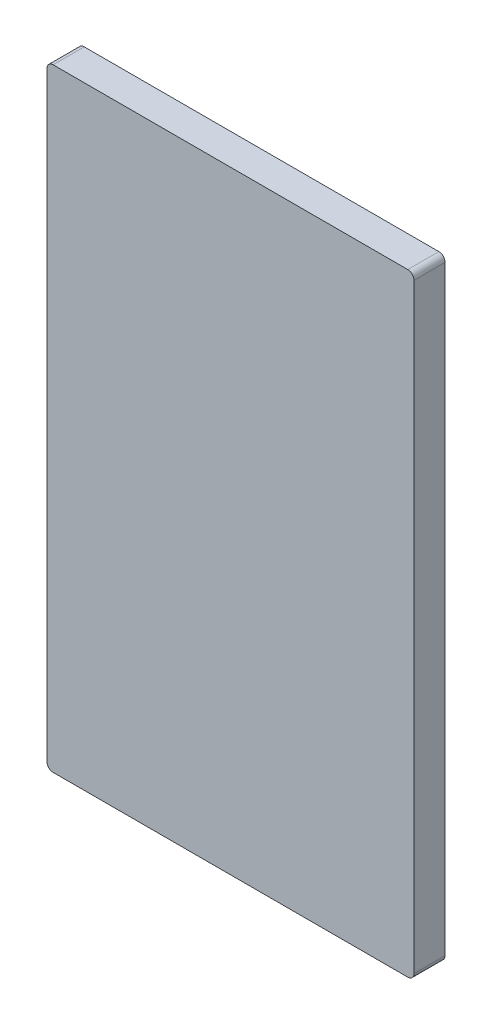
from build123d import *

# Parameters (mm, degrees)
BOSS_EXTRU_1_DEPTH = 10


with BuildPart() as part:
    # Esquisse2 → Boss.-Extru.1 (new body)
    with BuildSketch(Plane.XY):
        with BuildLine():
            Line((-71.564965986, 146.905555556), (42.435034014, 146.905555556))
            ThreePointArc((42.435034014, 146.905555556), (43.849247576, 146.319769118), (44.435034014, 144.905555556))
            Line((44.435034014, 144.905555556), (44.435034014, -48.094444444))
            ThreePointArc((44.435034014, -48.094444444), (43.849247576, -49.508658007), (42.435034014, -50.094444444))
            Line((42.435034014, -50.094444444), (-71.564965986, -50.094444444))
            ThreePointArc((-71.564965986, -50.094444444), (-72.979179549, -49.508658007), (-73.564965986, -48.094444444))
            Line((-73.564965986, -48.094444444), (-73.564965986, 144.905555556))
            ThreePointArc((-73.564965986, 144.905555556), (-72.979179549, 146.319769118), (-71.564965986, 146.905555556))
        make_face()
    extrude(amount=BOSS_EXTRU_1_DEPTH)


solid = part.part
